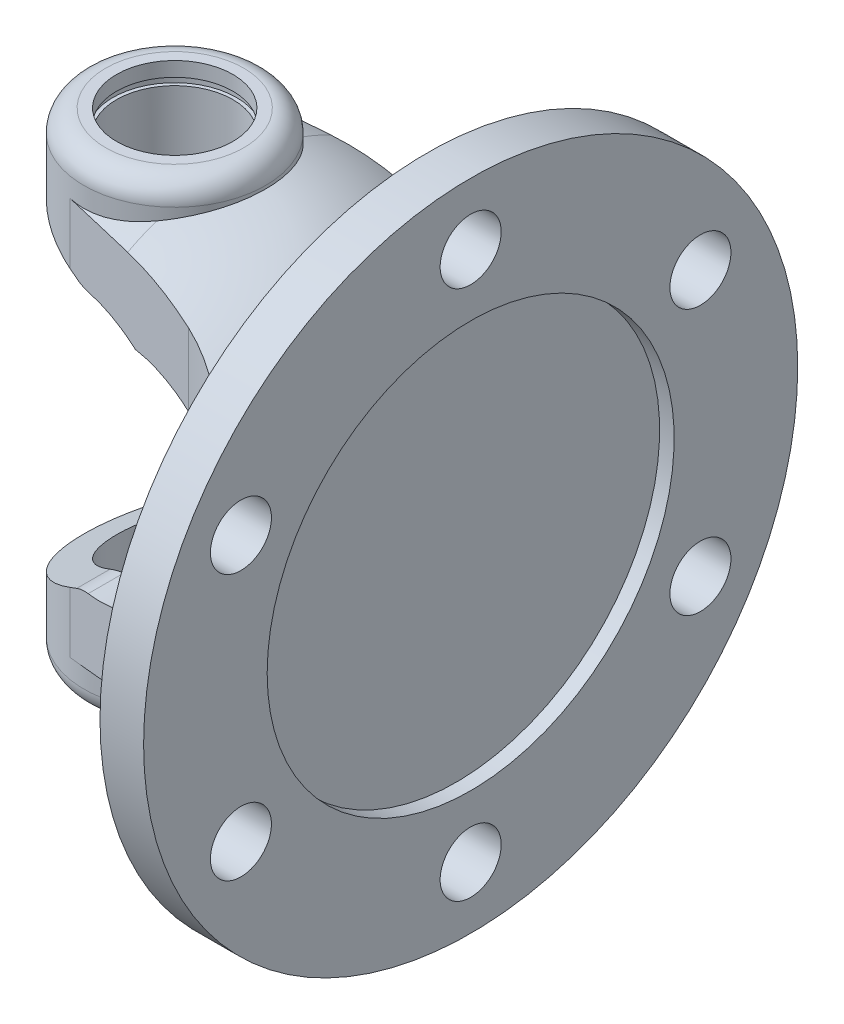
from build123d import *
from build123d.topology import SkipClean

# Parameters (mm, degrees)
CUT_EXTRUDE1_DEPTH       = 76.55013615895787
CUT_EXTRUDE1_DEPTH_BACK  = 76.55013615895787
CUT_EXTRUDE2_DEPTH       = 76.55013615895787
CUT_EXTRUDE2_DEPTH_BACK  = 76.55013615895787
FILLET1_R                = 5
SKETCH5_R                = 8
CUT_EXTRUDE3_DEPTH       = 99.82723852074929
SKETCH6_W                = 0.5
SKETCH6_H                = 1
M8_CLEARANCE_HOLE1_D     = 8.4
M8_CLEARANCE_HOLE1_DEPTH = 6.001
CIRPATTERN1_COUNT        = 6
CHAMFER1_SIZE            = 1.5


with BuildPart() as part:
    # Sketch1 → Revolve1 (revolve)
    with BuildSketch(Plane.XY, mode=Mode.PRIVATE) as revolve1_sk:
        with BuildLine():
            Line((-12.5, 0), (38.716373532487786, 0))
            Line((38.716373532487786, 0), (38.716373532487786, 28))
            Line((38.716373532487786, 28), (40.71637353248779, 28))
            Line((40.71637353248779, 28), (40.7163735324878, 45))
            Line((40.7163735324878, 45), (34.7163735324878, 45))
            Line((34.7163735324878, 45), (34.7163735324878, 19))
            Line((34.7163735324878, 19), (30.716373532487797, 19))
            ThreePointArc((30.716373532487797, 19), (20.345232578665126, 27.110883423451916), (7.4999999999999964, 30.000000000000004))
            Line((7.4999999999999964, 30.000000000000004), (-12.500000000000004, 30))
            Line((-12.500000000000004, 30), (-12.5, 0))
        make_face()
    revolve(revolve1_sk.sketch.rotate(Axis((-12.5, 0, 0), (1, 0, 0)), 90), axis=Axis((-12.5, 0, 0), (1, 0, 0)))

    # Sketch2 → Cut-Extrude1 (cut, two sides: drawn at the far end of the back side and taken through both)
    with BuildSketch(Plane(origin=(0, 0, 0), x_dir=(1, 0, 0), z_dir=(0, 1, 0)).offset(-CUT_EXTRUDE1_DEPTH_BACK)):
        with BuildLine():
            Line((28.500000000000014, -21.424285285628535), (28.500000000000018, -41.42428528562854))
            Line((28.500000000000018, -41.42428528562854), (-41.499999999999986, -41.42428528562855))
            Line((-41.499999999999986, -41.42428528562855), (-41.499999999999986, 41.42428528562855))
            Line((-41.499999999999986, 41.42428528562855), (28.500000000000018, 41.42428528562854))
            Line((28.500000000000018, 41.42428528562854), (28.500000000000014, 21.424285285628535))
            ThreePointArc((28.500000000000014, 21.424285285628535), (23.504274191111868, 17.71131837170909), (17.60901080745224, 15.714002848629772))
            Line((17.60901080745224, 15.714002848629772), (-2.1199172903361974, 12.31892652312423))
            ThreePointArc((-2.1199172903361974, 12.31892652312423), (-12.5, 1.53e-15), (-2.1199172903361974, -12.31892652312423))
            Line((-2.1199172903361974, -12.31892652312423), (17.60901080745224, -15.714002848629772))
            ThreePointArc((17.60901080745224, -15.714002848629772), (23.504274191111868, -17.71131837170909), (28.500000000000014, -21.424285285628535))
        make_face()
    extrude(amount=CUT_EXTRUDE1_DEPTH + CUT_EXTRUDE1_DEPTH_BACK, mode=Mode.SUBTRACT)

    # Sketch3 → Cut-Extrude2 (cut, two sides: drawn at the far end of the back side and taken through both)
    with BuildSketch(Plane.XY.offset(-CUT_EXTRUDE2_DEPTH_BACK)):
        Polygon((-12.499999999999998, 24), (3.9e-15, 18), (8.24e-15, -18.000000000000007), (-12.499999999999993, -24.000000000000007), align=None)
    extrude(amount=CUT_EXTRUDE2_DEPTH + CUT_EXTRUDE2_DEPTH_BACK, mode=Mode.SUBTRACT)

    # Sketch7 → Cut-Revolve2 (revolve, cut)
    with BuildSketch(Plane(origin=(0, 0, 0), x_dir=(0, 0, -1), z_dir=(1, 1.2e-16, 0))):
        with BuildLine():
            Line((-20.000000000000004, 18.000000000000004), (-8, 18.000000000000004))
            ThreePointArc((-8, 18.000000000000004), (1.21e-15, 19.69771560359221), (8, 18.000000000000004))
            Line((8, 18.000000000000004), (20.000000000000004, 18.000000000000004))
            Line((20.000000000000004, 18.000000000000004), (20, -3.47e-15))
            Line((20, -3.47e-15), (-20, -3.47e-15))
            Line((-20, -3.47e-15), (-20.000000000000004, 18.000000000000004))
        make_face()
    revolve(axis=Axis((0, -3.47e-15, 20), (0, 0, -1)), mode=Mode.SUBTRACT)

    # Fillet1
    fillet1_edges = [part.edges().sort_by_distance(p)[0] for p in [
        (8.24e-15, -18.000000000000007, -10.341867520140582),
        (8.24e-15, -18.000000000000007, 10.341867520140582),
        (3.9e-15, 18, -10.341867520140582),
        (3.9e-15, 18, 10.341867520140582),
    ]]
    fillet(fillet1_edges, radius=FILLET1_R)

    # Sketch4 → Revolve2 (revolve)
    with SkipClean():  # the faces are left unmerged after this step: merging them gives an invalid solid
        with BuildSketch(Plane.XY, mode=Mode.PRIVATE) as revolve2_sk:
            with BuildLine():
                Line((-9.500000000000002, 33), (-4e-17, 33))
                Line((-4e-17, 33), (1.1e-15, 23.99999999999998))
                Line((1.1e-15, 23.99999999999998), (-12.499999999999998, 23.999999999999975))
                Line((-12.499999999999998, 23.999999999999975), (-12.500000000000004, 30))
                ThreePointArc((-12.500000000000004, 30), (-11.621320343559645, 32.121320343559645), (-9.500000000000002, 33))
            make_face()
        revolve2 = revolve(revolve2_sk.sketch.rotate(Axis((-4e-17, 33, 0), (1.3e-16, -1, 0)), 279.764178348), axis=Axis((-4e-17, 33, 0), (1.3e-16, -1, 0)))

    # Mirror1: Revolve2 across plane
    add(revolve2.mirror(Plane.ZX))

    # Sketch5 → Cut-Extrude3 (cut, through all)
    with BuildSketch(Plane(origin=(-4.2e-15, 33, 0), x_dir=(1, 1.3e-16, 0), z_dir=(-1.3e-16, 1, 0))):
        with Locations(Location((0, 0, 0), (0, 0, 96.893245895))):
            Circle(SKETCH5_R)
    extrude(amount=-CUT_EXTRUDE3_DEPTH, mode=Mode.SUBTRACT)

    # Sketch6 → Cut-Revolve1 (revolve, cut)
    with BuildSketch(Plane.XY, mode=Mode.PRIVATE) as cut_revolve1_sk:
        with Locations((8.25, 30.500000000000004)):
            Rectangle(SKETCH6_W, SKETCH6_H)
        with Locations((8.25, -30.500000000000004)):
            Rectangle(SKETCH6_W, SKETCH6_H)
    revolve(cut_revolve1_sk.sketch.rotate(Axis((0, 0, 0), (0, 1, 0)), 180), axis=Axis((0, 0, 0), (0, 1, 0)), mode=Mode.SUBTRACT)

    # Sketch8 → Cut-Revolve3 (revolve, cut)
    with BuildSketch(Plane(origin=(0, 0, 0), x_dir=(1, 0, 0), z_dir=(0, 1, 0))):
        with BuildLine():
            Line((19.37395372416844, 3.5566721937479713), (6.383572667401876, 11.056672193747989))
            Line((6.383572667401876, 11.056672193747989), (14.563591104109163, 25.224879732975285))
            Line((14.563591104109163, 25.224879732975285), (25.500000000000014, 18.910741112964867))
            ThreePointArc((25.500000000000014, 18.910741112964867), (24.097569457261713, 10.571154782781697), (19.37395372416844, 3.5566721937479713))
        make_face()
    cut_revolve3 = revolve(axis=Axis((-11.032946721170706, 0, 19.109624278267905), (0.500000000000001, 0, -0.8660254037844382)), mode=Mode.SUBTRACT)

    # Mirror2: Cut-Revolve3 across plane
    add(cut_revolve3.mirror(Plane.XY), mode=Mode.SUBTRACT)

    # M8 Clearance Hole1
    with Locations(Plane(origin=(40.71637353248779, 0, 0), x_dir=(0, 0, -1), z_dir=(1, 0, 0))):
        with Locations((0, 36.5)):
            m8_clearance_hole1 = Hole(M8_CLEARANCE_HOLE1_D / 2, depth=M8_CLEARANCE_HOLE1_DEPTH)

    # CirPattern1: M8 Clearance Hole1 ×6 about axis
    cirpattern1_axis = Axis((0, -9.3e-16, -4.31e-14), (1, 0, 0))
    for i in range(1, CIRPATTERN1_COUNT):
        add(m8_clearance_hole1.rotate(cirpattern1_axis, i * 360 / CIRPATTERN1_COUNT), mode=Mode.SUBTRACT)

    # Chamfer1
    chamfer1_edges = [part.edges().sort_by_distance(p)[0] for p in [
        (34.7163735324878, -4.44e-15, -19),
    ]]
    chamfer(chamfer1_edges, length=CHAMFER1_SIZE)


solid = part.part
